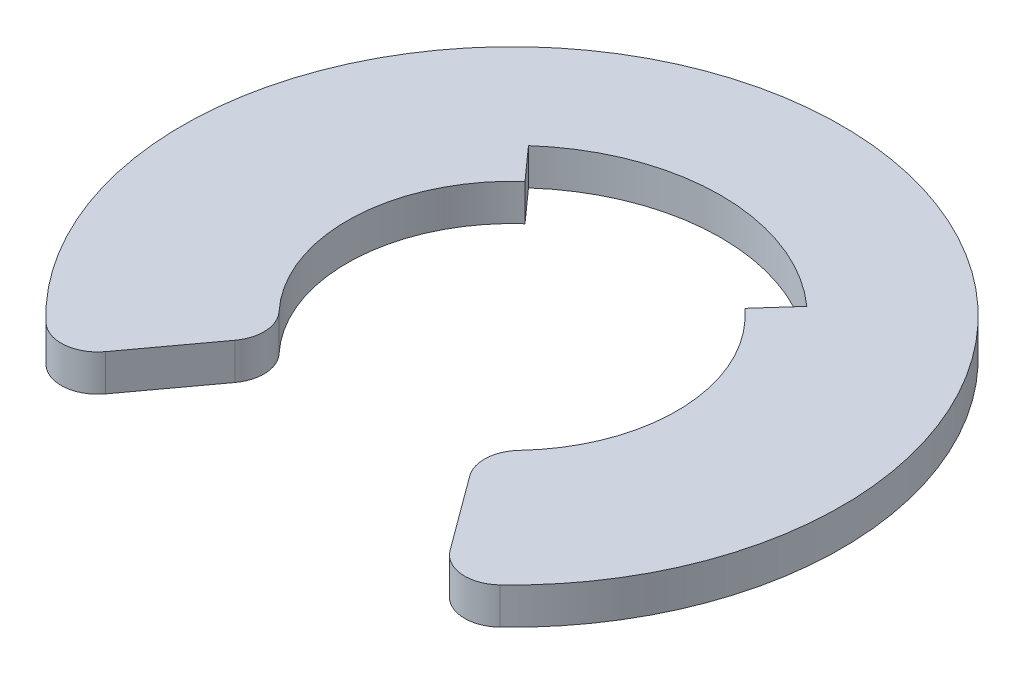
from build123d import *

# Parameters (mm, degrees)
SKETCH1_R                = 4.5
BASE_EXTRUDE_DEPTH       = 0.5
SKETCH2_R                = 2.25
CUT_EXTRUDE1_DEPTH       = 7.383572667
CUT_EXTRUDE_1_DEPTH      = 7.383572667
CUT_EXTRUDE_1_DEPTH_BACK = 7.383572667
FILLET_1_R               = 0.5
CUT_EXTRUDE_1_2_DEPTH    = 7.383572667


with BuildPart() as part:
    # Sketch1 → Base-Extrude (new body)
    with BuildSketch(Plane(origin=(0, 0, 0), x_dir=(1, 0, 0), z_dir=(0, 1, 0))):
        with Locations(Location((0, 0, 0), (0, 0, 270))):
            Circle(SKETCH1_R)
    extrude(amount=BASE_EXTRUDE_DEPTH)

    # Sketch2 → Cut-Extrude1 (cut, through all)
    with BuildSketch(Plane(origin=(0, 0.5, 0), x_dir=(-1, 0, 0), z_dir=(0, 1, 0))):
        with Locations(Location((0, 0, 0), (0, 0, 90))):
            Circle(SKETCH2_R)
    extrude(amount=-CUT_EXTRUDE1_DEPTH, mode=Mode.SUBTRACT)

    # Sketch 1 → Cut-Extrude 1 (cut, two sides: drawn at the far end of the back side and taken through both)
    with BuildSketch(Plane(origin=(0, 0.5, 0), x_dir=(1, 0, 0), z_dir=(0, 1, 0)).offset(-CUT_EXTRUDE_1_DEPTH_BACK)):
        Polygon((22.956354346, -31.217717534), (3.177065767, -4.320404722), (0, 0), (-3.177065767, -4.320404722), (-22.956354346, -31.217717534), (-22.956354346, -97.991535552), (22.956354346, -97.991535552), align=None)
    extrude(amount=CUT_EXTRUDE_1_DEPTH + CUT_EXTRUDE_1_DEPTH_BACK, mode=Mode.SUBTRACT)

    # Fillet 1
    fillet_1_edges = [part.edges().sort_by_distance(p)[0] for p in [
        (-1.332959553, 0.25, 1.812655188),
        (1.332959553, 0.25, 1.812655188),
        (2.665919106, 0.25, 3.625310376),
        (-2.665919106, 0.25, 3.625310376),
    ]]
    fillet(fillet_1_edges, radius=FILLET_1_R)

    # Sketch 2 → Cut-Extrude 1 2 (cut, through all)
    with BuildSketch(Plane(origin=(0, 0.5, 0), x_dir=(1, 0, 0), z_dir=(0, 1, 0))):
        with BuildLine():
            ThreePointArc((1.5, 1.677050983), (0, 2.25), (-1.5, 1.677050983))
            Line((-1.5, 1.677050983), (-1.9, 2.124264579))
            ThreePointArc((-1.9, 2.124264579), (0, 2.85), (1.9, 2.124264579))
            Line((1.9, 2.124264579), (1.5, 1.677050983))
        make_face()
    extrude(amount=-CUT_EXTRUDE_1_2_DEPTH, mode=Mode.SUBTRACT)


solid = part.part
